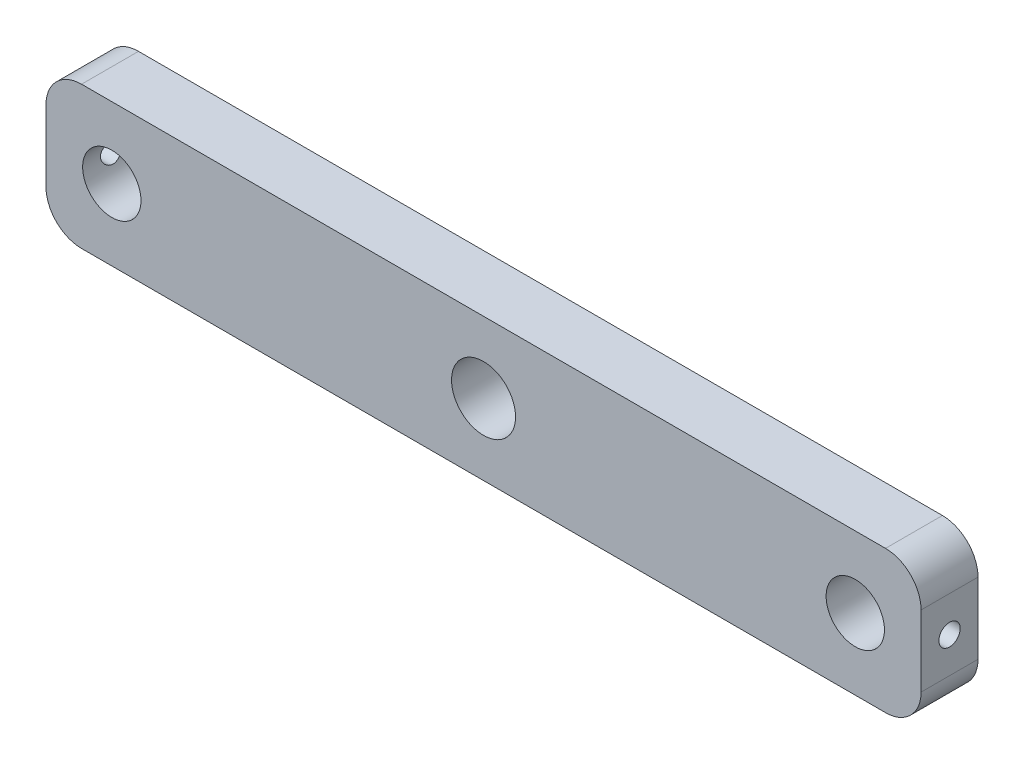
from build123d import *

# Parameters (mm, degrees)
SKETCH1_W               = 123
SKETCH1_H               = 20
SKETCH1_R               = 4.1
SKETCH1_R_2             = 4.5
BOSS_EXTRUDE1_DEPTH     = 8
FILLET1_R               = 5
FILLET2_R               = 5
CUT_EXTRUDE1_REACH      = 126.872
CUT_EXTRUDE1_END_RADIUS = 4.1
SKETCH2_R               = 1.5
CUT_EXTRUDE2_REACH      = 126.872
CUT_EXTRUDE2_END_RADIUS = 4.1
SKETCH3_R               = 1.5


with BuildPart() as part:
    # Sketch1 → Boss-Extrude1 (new body)
    with BuildSketch(Plane.XY):
        with Locations((-61.5, 10)):
            Rectangle(SKETCH1_W, SKETCH1_H)
        with Locations((-113.75, 10)):
            Circle(SKETCH1_R, mode=Mode.SUBTRACT)
        with Locations((-61.5, 10)):
            Circle(SKETCH1_R_2, mode=Mode.SUBTRACT)
        with Locations((-9.25, 10)):
            Circle(SKETCH1_R, mode=Mode.SUBTRACT)
    extrude(amount=BOSS_EXTRUDE1_DEPTH)

    # Fillet1
    fillet1_edges = [part.edges().sort_by_distance(p)[0] for p in [
        (-123, 20, 4),
    ]]
    fillet(fillet1_edges, radius=FILLET1_R)

    # Fillet2
    fillet2_edges = [part.edges().sort_by_distance(p)[0] for p in [
        (0, 0, 4),
        (-123, 0, 4),
        (0, 20, 4),
    ]]
    fillet(fillet2_edges, radius=FILLET2_R)

    # Cut-Extrude1: up to this cylinder (the profile starts outside it)
    cut_extrude1_end = Plane(origin=(-113.75, 10, 4), z_dir=(0, 0, -1)) * Cylinder(CUT_EXTRUDE1_END_RADIUS, 262.944, mode=Mode.PRIVATE)
    # Sketch2 → Cut-Extrude1 (cut, up to the surface)
    with BuildSketch(Plane.ZY.offset(123), mode=Mode.PRIVATE) as cut_extrude1_sk1:
        with Locations((4, 10)):
            Circle(SKETCH2_R)
    cut_extrude1_tool1 = extrude(cut_extrude1_sk1.sketch, amount=-CUT_EXTRUDE1_REACH, mode=Mode.PRIVATE) - cut_extrude1_end
    add(cut_extrude1_tool1.solids().sort_by_distance((-123, 10, 4))[0], mode=Mode.SUBTRACT)

    # Cut-Extrude2: up to this cylinder (the profile starts outside it)
    cut_extrude2_end = Plane(origin=(-9.25, 10, 4), z_dir=(0, 0, -1)) * Cylinder(CUT_EXTRUDE2_END_RADIUS, 262.944, mode=Mode.PRIVATE)
    # Sketch3 → Cut-Extrude2 (cut, up to the surface)
    with BuildSketch(Plane(origin=(0, 0, 0), x_dir=(0, 0, -1), z_dir=(1, 0, 0)), mode=Mode.PRIVATE) as cut_extrude2_sk1:
        with Locations(Location((-4, 10, 0), (0, 0, 180))):
            Circle(SKETCH3_R)
    cut_extrude2_tool1 = extrude(cut_extrude2_sk1.sketch, amount=-CUT_EXTRUDE2_REACH, mode=Mode.PRIVATE) - cut_extrude2_end
    add(cut_extrude2_tool1.solids().sort_by_distance((0, 10, 4))[0], mode=Mode.SUBTRACT)


solid = part.part
